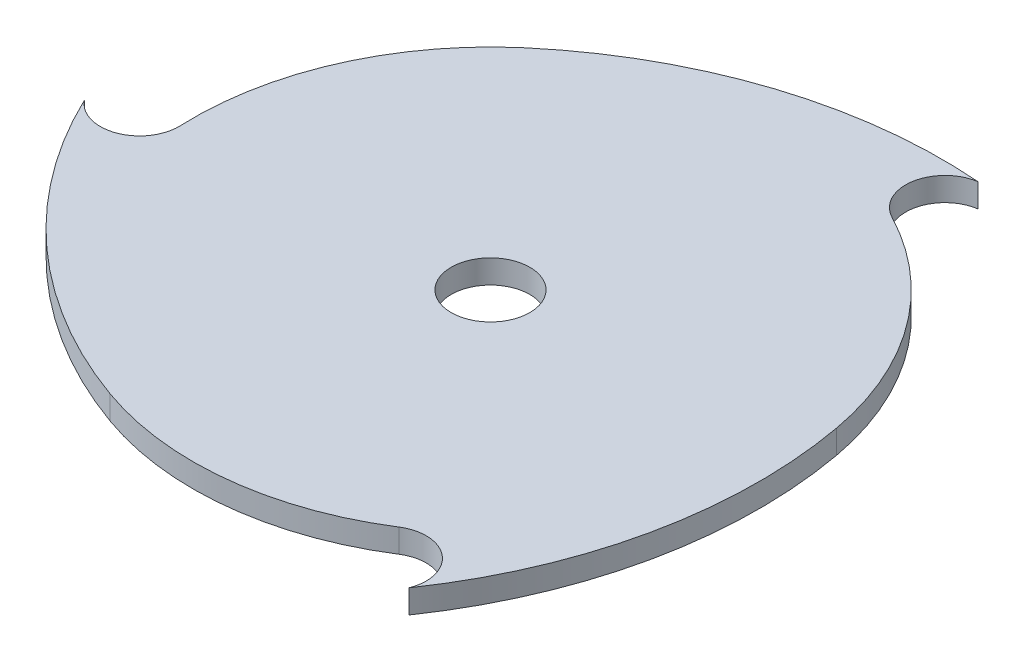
ISO-10303-21;
HEADER;
FILE_DESCRIPTION(('STEP AP214'),'2;1');
FILE_NAME('part.step','',(''),(''),'','','');
FILE_SCHEMA(('AUTOMOTIVE_DESIGN { 1 0 10303 214 1 1 1 1 }'));
ENDSEC;
DATA;
#1=APPLICATION_CONTEXT('core data for automotive mechanical design processes');
#2=APPLICATION_PROTOCOL_DEFINITION('international standard','automotive_design',2000,#1);
#3=PRODUCT_CONTEXT('',#1,'mechanical');
#4=PRODUCT('Part','Part','',(#3));
#5=PRODUCT_RELATED_PRODUCT_CATEGORY('part','',(#4));
#6=PRODUCT_DEFINITION_FORMATION('','',#4);
#7=PRODUCT_DEFINITION_CONTEXT('part definition',#1,'design');
#8=PRODUCT_DEFINITION('design','',#6,#7);
#9=PRODUCT_DEFINITION_SHAPE('','',#8);
#10=(LENGTH_UNIT() NAMED_UNIT(*) SI_UNIT(.MILLI.,.METRE.));
#11=(NAMED_UNIT(*) PLANE_ANGLE_UNIT() SI_UNIT($,.RADIAN.));
#12=(NAMED_UNIT(*) SI_UNIT($,.STERADIAN.) SOLID_ANGLE_UNIT());
#13=UNCERTAINTY_MEASURE_WITH_UNIT(LENGTH_MEASURE(1.E-05),#10,'distance_accuracy_value','');
#14=(GEOMETRIC_REPRESENTATION_CONTEXT(3) GLOBAL_UNCERTAINTY_ASSIGNED_CONTEXT((#13)) GLOBAL_UNIT_ASSIGNED_CONTEXT((#10,
#11,#12)) REPRESENTATION_CONTEXT('',''));
#15=CARTESIAN_POINT('',(0.,0.,0.));
#16=DIRECTION('',(0.,0.,1.));
#17=DIRECTION('',(1.,0.,0.));
#18=AXIS2_PLACEMENT_3D('',#15,#16,#17);
#19=CARTESIAN_POINT('',(14.342518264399,3.,16.8876916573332));
#20=DIRECTION('',(0.,-1.,0.));
#21=DIRECTION('',(0.,0.,-1.));
#22=AXIS2_PLACEMENT_3D('',#19,#20,#21);
#23=CYLINDRICAL_SURFACE('',#22,60.);
#24=CARTESIAN_POINT('',(14.342518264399,0.,16.8876916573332));
#25=DIRECTION('',(0.,1.,0.));
#26=DIRECTION('',(0.,0.,1.));
#27=AXIS2_PLACEMENT_3D('',#24,#25,#26);
#28=CIRCLE('',#27,60.);
#29=CARTESIAN_POINT('',(-24.4974869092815,0.,-28.8447257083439));
#30=VERTEX_POINT('',#29);
#31=CARTESIAN_POINT('',(19.0815873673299,0.,-42.924859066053));
#32=VERTEX_POINT('',#31);
#33=EDGE_CURVE('E138',#30,#32,#28,.F.);
#34=ORIENTED_EDGE('',*,*,#33,.F.);
#35=DIRECTION('',(0.,-1.,0.));
#36=VECTOR('',#35,1.);
#37=CARTESIAN_POINT('',(-24.4974869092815,3.,-28.8447257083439));
#38=LINE('',#37,#36);
#39=CARTESIAN_POINT('',(-24.4974869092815,3.,-28.8447257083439));
#40=VERTEX_POINT('',#39);
#41=EDGE_CURVE('E11',#40,#30,#38,.T.);
#42=ORIENTED_EDGE('',*,*,#41,.F.);
#43=CARTESIAN_POINT('',(14.342518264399,3.,16.8876916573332));
#44=DIRECTION('',(0.,1.,0.));
#45=DIRECTION('',(0.,0.,1.));
#46=AXIS2_PLACEMENT_3D('',#43,#44,#45);
#47=CIRCLE('',#46,60.);
#48=CARTESIAN_POINT('',(19.0815873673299,3.,-42.924859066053));
#49=VERTEX_POINT('',#48);
#50=EDGE_CURVE('E194',#40,#49,#47,.F.);
#51=ORIENTED_EDGE('',*,*,#50,.T.);
#52=DIRECTION('',(0.,-1.,0.));
#53=VECTOR('',#52,1.);
#54=CARTESIAN_POINT('',(19.0815873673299,3.,-42.924859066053));
#55=LINE('',#54,#53);
#56=EDGE_CURVE('E52',#49,#32,#55,.T.);
#57=ORIENTED_EDGE('',*,*,#56,.T.);
#58=EDGE_LOOP('',(#34,#42,#51,#57));
#59=FACE_BOUND('',#58,.T.);
#60=ADVANCED_FACE('F35',(#59),#23,.T.);
#61=CARTESIAN_POINT('',(0.,3.,0.));
#62=DIRECTION('',(0.,-1.,0.));
#63=DIRECTION('',(0.,0.,-1.));
#64=AXIS2_PLACEMENT_3D('',#61,#62,#63);
#65=CYLINDRICAL_SURFACE('',#64,37.8436925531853);
#66=CARTESIAN_POINT('',(0.,0.,0.));
#67=DIRECTION('',(0.,1.,0.));
#68=DIRECTION('',(0.,0.,1.));
#69=AXIS2_PLACEMENT_3D('',#66,#67,#68);
#70=CIRCLE('',#69,37.8436925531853);
#71=CARTESIAN_POINT('',(-37.80950634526,0.,1.6081965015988));
#72=VERTEX_POINT('',#71);
#73=EDGE_CURVE('E140',#30,#72,#70,.T.);
#74=ORIENTED_EDGE('',*,*,#73,.T.);
#75=DIRECTION('',(0.,-1.,0.));
#76=VECTOR('',#75,1.);
#77=CARTESIAN_POINT('',(-37.80950634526,3.,1.6081965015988));
#78=LINE('',#77,#76);
#79=CARTESIAN_POINT('',(-37.80950634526,3.,1.6081965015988));
#80=VERTEX_POINT('',#79);
#81=EDGE_CURVE('E44',#80,#72,#78,.T.);
#82=ORIENTED_EDGE('',*,*,#81,.F.);
#83=CARTESIAN_POINT('',(0.,3.,0.));
#84=DIRECTION('',(0.,1.,0.));
#85=DIRECTION('',(0.,0.,1.));
#86=AXIS2_PLACEMENT_3D('',#83,#84,#85);
#87=CIRCLE('',#86,37.8436925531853);
#88=EDGE_CURVE('E190',#40,#80,#87,.T.);
#89=ORIENTED_EDGE('',*,*,#88,.F.);
#90=ORIENTED_EDGE('',*,*,#41,.T.);
#91=EDGE_LOOP('',(#74,#82,#89,#90));
#92=FACE_BOUND('',#91,.T.);
#93=ADVANCED_FACE('F179',(#92),#65,.T.);
#94=CARTESIAN_POINT('',(-42.8049895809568,3.,1.82067530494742));
#95=DIRECTION('',(0.,-1.,0.));
#96=DIRECTION('',(0.,0.,-1.));
#97=AXIS2_PLACEMENT_3D('',#94,#95,#96);
#98=CYLINDRICAL_SURFACE('',#97,5.);
#99=CARTESIAN_POINT('',(-42.8049895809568,0.,1.82067530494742));
#100=DIRECTION('',(0.,1.,0.));
#101=DIRECTION('',(0.,0.,1.));
#102=AXIS2_PLACEMENT_3D('',#99,#100,#101);
#103=CIRCLE('',#102,5.);
#104=CARTESIAN_POINT('',(-46.7148120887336,0.,4.93729012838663));
#105=VERTEX_POINT('',#104);
#106=EDGE_CURVE('E143',#105,#72,#103,.T.);
#107=ORIENTED_EDGE('',*,*,#106,.F.);
#108=DIRECTION('',(0.,-1.,0.));
#109=VECTOR('',#108,1.);
#110=CARTESIAN_POINT('',(-46.7148120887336,3.,4.93729012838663));
#111=LINE('',#110,#109);
#112=CARTESIAN_POINT('',(-46.7148120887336,3.,4.93729012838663));
#113=VERTEX_POINT('',#112);
#114=EDGE_CURVE('E169',#113,#105,#111,.T.);
#115=ORIENTED_EDGE('',*,*,#114,.F.);
#116=CARTESIAN_POINT('',(-42.8049895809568,3.,1.82067530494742));
#117=DIRECTION('',(0.,1.,0.));
#118=DIRECTION('',(0.,0.,1.));
#119=AXIS2_PLACEMENT_3D('',#116,#117,#118);
#120=CIRCLE('',#119,5.);
#121=EDGE_CURVE('E176',#113,#80,#120,.T.);
#122=ORIENTED_EDGE('',*,*,#121,.T.);
#123=ORIENTED_EDGE('',*,*,#81,.T.);
#124=EDGE_LOOP('',(#107,#115,#122,#123));
#125=FACE_BOUND('',#124,.T.);
#126=ADVANCED_FACE('F174',(#125),#98,.F.);
#127=CARTESIAN_POINT('',(7.45391085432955,3.,-20.8648309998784));
#128=DIRECTION('',(0.,-1.,0.));
#129=DIRECTION('',(0.,0.,-1.));
#130=AXIS2_PLACEMENT_3D('',#127,#128,#129);
#131=CYLINDRICAL_SURFACE('',#130,60.);
#132=CARTESIAN_POINT('',(7.45391085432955,0.,-20.8648309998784));
#133=DIRECTION('',(0.,1.,0.));
#134=DIRECTION('',(0.,0.,1.));
#135=AXIS2_PLACEMENT_3D('',#132,#133,#134);
#136=CIRCLE('',#135,60.);
#137=CARTESIAN_POINT('',(-12.7315217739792,0.,35.6378088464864));
#138=VERTEX_POINT('',#137);
#139=EDGE_CURVE('E146',#138,#105,#136,.F.);
#140=ORIENTED_EDGE('',*,*,#139,.F.);
#141=DIRECTION('',(0.,-1.,0.));
#142=VECTOR('',#141,1.);
#143=CARTESIAN_POINT('',(-12.7315217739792,3.,35.6378088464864));
#144=LINE('',#143,#142);
#145=CARTESIAN_POINT('',(-12.7315217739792,3.,35.6378088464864));
#146=VERTEX_POINT('',#145);
#147=EDGE_CURVE('E167',#146,#138,#144,.T.);
#148=ORIENTED_EDGE('',*,*,#147,.F.);
#149=CARTESIAN_POINT('',(7.45391085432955,3.,-20.8648309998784));
#150=DIRECTION('',(0.,1.,0.));
#151=DIRECTION('',(0.,0.,1.));
#152=AXIS2_PLACEMENT_3D('',#149,#150,#151);
#153=CIRCLE('',#152,60.);
#154=EDGE_CURVE('E189',#146,#113,#153,.F.);
#155=ORIENTED_EDGE('',*,*,#154,.T.);
#156=ORIENTED_EDGE('',*,*,#114,.T.);
#157=EDGE_LOOP('',(#140,#148,#155,#156));
#158=FACE_BOUND('',#157,.T.);
#159=ADVANCED_FACE('F185',(#158),#131,.T.);
#160=CARTESIAN_POINT('',(0.,3.,0.));
#161=DIRECTION('',(0.,-1.,0.));
#162=DIRECTION('',(0.,0.,-1.));
#163=AXIS2_PLACEMENT_3D('',#160,#161,#162);
#164=CYLINDRICAL_SURFACE('',#163,37.8436925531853);
#165=CARTESIAN_POINT('',(0.,0.,0.));
#166=DIRECTION('',(0.,1.,0.));
#167=DIRECTION('',(0.,0.,1.));
#168=AXIS2_PLACEMENT_3D('',#165,#166,#167);
#169=CIRCLE('',#168,37.8436925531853);
#170=CARTESIAN_POINT('',(20.2974921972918,0.,31.9398947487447));
#171=VERTEX_POINT('',#170);
#172=EDGE_CURVE('E149',#138,#171,#169,.T.);
#173=ORIENTED_EDGE('',*,*,#172,.T.);
#174=DIRECTION('',(0.,-1.,0.));
#175=VECTOR('',#174,1.);
#176=CARTESIAN_POINT('',(20.2974921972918,3.,31.9398947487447));
#177=LINE('',#176,#175);
#178=CARTESIAN_POINT('',(20.2974921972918,3.,31.9398947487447));
#179=VERTEX_POINT('',#178);
#180=EDGE_CURVE('E165',#179,#171,#177,.T.);
#181=ORIENTED_EDGE('',*,*,#180,.F.);
#182=CARTESIAN_POINT('',(0.,3.,0.));
#183=DIRECTION('',(0.,1.,0.));
#184=DIRECTION('',(0.,0.,1.));
#185=AXIS2_PLACEMENT_3D('',#182,#183,#184);
#186=CIRCLE('',#185,37.8436925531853);
#187=EDGE_CURVE('E192',#146,#179,#186,.T.);
#188=ORIENTED_EDGE('',*,*,#187,.F.);
#189=ORIENTED_EDGE('',*,*,#147,.T.);
#190=EDGE_LOOP('',(#173,#181,#188,#189));
#191=FACE_BOUND('',#190,.T.);
#192=ADVANCED_FACE('F224',(#191),#164,.T.);
#193=CARTESIAN_POINT('',(22.9792458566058,3.,36.1598707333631));
#194=DIRECTION('',(0.,-1.,0.));
#195=DIRECTION('',(0.,0.,-1.));
#196=AXIS2_PLACEMENT_3D('',#193,#194,#195);
#197=CYLINDRICAL_SURFACE('',#196,5.);
#198=CARTESIAN_POINT('',(22.9792458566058,0.,36.1598707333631));
#199=DIRECTION('',(0.,1.,0.));
#200=DIRECTION('',(0.,0.,1.));
#201=AXIS2_PLACEMENT_3D('',#198,#199,#200);
#202=CIRCLE('',#201,5.);
#203=CARTESIAN_POINT('',(27.6332247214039,0.,37.9875689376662));
#204=VERTEX_POINT('',#203);
#205=EDGE_CURVE('E152',#204,#171,#202,.T.);
#206=ORIENTED_EDGE('',*,*,#205,.F.);
#207=DIRECTION('',(0.,-1.,0.));
#208=VECTOR('',#207,1.);
#209=CARTESIAN_POINT('',(27.6332247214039,3.,37.9875689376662));
#210=LINE('',#209,#208);
#211=CARTESIAN_POINT('',(27.6332247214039,3.,37.9875689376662));
#212=VERTEX_POINT('',#211);
#213=EDGE_CURVE('E117',#212,#204,#210,.T.);
#214=ORIENTED_EDGE('',*,*,#213,.F.);
#215=CARTESIAN_POINT('',(22.9792458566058,3.,36.1598707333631));
#216=DIRECTION('',(0.,1.,0.));
#217=DIRECTION('',(0.,0.,1.));
#218=AXIS2_PLACEMENT_3D('',#215,#216,#217);
#219=CIRCLE('',#218,5.);
#220=EDGE_CURVE('E127',#212,#179,#219,.T.);
#221=ORIENTED_EDGE('',*,*,#220,.T.);
#222=ORIENTED_EDGE('',*,*,#180,.T.);
#223=EDGE_LOOP('',(#206,#214,#221,#222));
#224=FACE_BOUND('',#223,.T.);
#225=ADVANCED_FACE('F200',(#224),#197,.F.);
#226=CARTESIAN_POINT('',(-21.7964291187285,3.,3.97713934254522));
#227=DIRECTION('',(0.,-1.,0.));
#228=DIRECTION('',(0.,0.,-1.));
#229=AXIS2_PLACEMENT_3D('',#226,#227,#228);
#230=CYLINDRICAL_SURFACE('',#229,60.);
#231=CARTESIAN_POINT('',(-21.7964291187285,0.,3.97713934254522));
#232=DIRECTION('',(0.,1.,0.));
#233=DIRECTION('',(0.,0.,1.));
#234=AXIS2_PLACEMENT_3D('',#231,#232,#233);
#235=CIRCLE('',#234,60.);
#236=CARTESIAN_POINT('',(37.2290086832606,0.,-6.79308313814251));
#237=VERTEX_POINT('',#236);
#238=EDGE_CURVE('E113',#237,#204,#235,.F.);
#239=ORIENTED_EDGE('',*,*,#238,.F.);
#240=DIRECTION('',(0.,-1.,0.));
#241=VECTOR('',#240,1.);
#242=CARTESIAN_POINT('',(37.2290086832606,3.,-6.79308313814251));
#243=LINE('',#242,#241);
#244=CARTESIAN_POINT('',(37.2290086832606,3.,-6.79308313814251));
#245=VERTEX_POINT('',#244);
#246=EDGE_CURVE('E108',#245,#237,#243,.T.);
#247=ORIENTED_EDGE('',*,*,#246,.F.);
#248=CARTESIAN_POINT('',(-21.7964291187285,3.,3.97713934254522));
#249=DIRECTION('',(0.,1.,0.));
#250=DIRECTION('',(0.,0.,1.));
#251=AXIS2_PLACEMENT_3D('',#248,#249,#250);
#252=CIRCLE('',#251,60.);
#253=EDGE_CURVE('E111',#245,#212,#252,.F.);
#254=ORIENTED_EDGE('',*,*,#253,.T.);
#255=ORIENTED_EDGE('',*,*,#213,.T.);
#256=EDGE_LOOP('',(#239,#247,#254,#255));
#257=FACE_BOUND('',#256,.T.);
#258=ADVANCED_FACE('F110',(#257),#230,.T.);
#259=CARTESIAN_POINT('',(0.,3.,0.));
#260=DIRECTION('',(0.,-1.,0.));
#261=DIRECTION('',(0.,0.,-1.));
#262=AXIS2_PLACEMENT_3D('',#259,#260,#261);
#263=CYLINDRICAL_SURFACE('',#262,37.8436925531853);
#264=CARTESIAN_POINT('',(0.,0.,0.));
#265=DIRECTION('',(0.,1.,0.));
#266=DIRECTION('',(0.,0.,1.));
#267=AXIS2_PLACEMENT_3D('',#264,#265,#266);
#268=CIRCLE('',#267,37.8436925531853);
#269=CARTESIAN_POINT('',(17.5120141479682,0.,-33.5480912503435));
#270=VERTEX_POINT('',#269);
#271=EDGE_CURVE('E156',#270,#237,#268,.F.);
#272=ORIENTED_EDGE('',*,*,#271,.F.);
#273=DIRECTION('',(0.,-1.,0.));
#274=VECTOR('',#273,1.);
#275=CARTESIAN_POINT('',(17.5120141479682,3.,-33.5480912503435));
#276=LINE('',#275,#274);
#277=CARTESIAN_POINT('',(17.5120141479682,3.,-33.5480912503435));
#278=VERTEX_POINT('',#277);
#279=EDGE_CURVE('E80',#278,#270,#276,.T.);
#280=ORIENTED_EDGE('',*,*,#279,.F.);
#281=CARTESIAN_POINT('',(0.,3.,0.));
#282=DIRECTION('',(0.,1.,0.));
#283=DIRECTION('',(0.,0.,1.));
#284=AXIS2_PLACEMENT_3D('',#281,#282,#283);
#285=CIRCLE('',#284,37.8436925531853);
#286=EDGE_CURVE('E125',#278,#245,#285,.F.);
#287=ORIENTED_EDGE('',*,*,#286,.T.);
#288=ORIENTED_EDGE('',*,*,#246,.T.);
#289=EDGE_LOOP('',(#272,#280,#287,#288));
#290=FACE_BOUND('',#289,.T.);
#291=ADVANCED_FACE('F129',(#290),#263,.T.);
#292=CARTESIAN_POINT('',(0.,3.,0.));
#293=DIRECTION('',(0.,-1.,0.));
#294=DIRECTION('',(0.,0.,-1.));
#295=AXIS2_PLACEMENT_3D('',#292,#293,#294);
#296=CYLINDRICAL_SURFACE('',#295,5.);
#297=CARTESIAN_POINT('',(0.,3.,0.));
#298=DIRECTION('',(0.,1.,0.));
#299=DIRECTION('',(0.,0.,1.));
#300=AXIS2_PLACEMENT_3D('',#297,#298,#299);
#301=CIRCLE('',#300,5.);
#302=CARTESIAN_POINT('',(0.,3.,5.));
#303=VERTEX_POINT('',#302);
#304=EDGE_CURVE('E161',#303,#303,#301,.T.);
#305=ORIENTED_EDGE('',*,*,#304,.T.);
#306=EDGE_LOOP('',(#305));
#307=FACE_BOUND('',#306,.T.);
#308=CARTESIAN_POINT('',(0.,0.,0.));
#309=DIRECTION('',(0.,1.,0.));
#310=DIRECTION('',(0.,0.,1.));
#311=AXIS2_PLACEMENT_3D('',#308,#309,#310);
#312=CIRCLE('',#311,5.);
#313=CARTESIAN_POINT('',(0.,0.,5.));
#314=VERTEX_POINT('',#313);
#315=EDGE_CURVE('E135',#314,#314,#312,.T.);
#316=ORIENTED_EDGE('',*,*,#315,.F.);
#317=EDGE_LOOP('',(#316));
#318=FACE_BOUND('',#317,.T.);
#319=ADVANCED_FACE('F37',(#307,#318),#296,.F.);
#320=CARTESIAN_POINT('',(19.825743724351,3.,-37.9805460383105));
#321=DIRECTION('',(0.,-1.,0.));
#322=DIRECTION('',(0.,0.,-1.));
#323=AXIS2_PLACEMENT_3D('',#320,#321,#322);
#324=CYLINDRICAL_SURFACE('',#323,5.);
#325=CARTESIAN_POINT('',(19.825743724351,0.,-37.9805460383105));
#326=DIRECTION('',(0.,1.,0.));
#327=DIRECTION('',(0.,0.,1.));
#328=AXIS2_PLACEMENT_3D('',#325,#326,#327);
#329=CIRCLE('',#328,5.);
#330=EDGE_CURVE('E158',#32,#270,#329,.T.);
#331=ORIENTED_EDGE('',*,*,#330,.F.);
#332=ORIENTED_EDGE('',*,*,#56,.F.);
#333=CARTESIAN_POINT('',(19.825743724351,3.,-37.9805460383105));
#334=DIRECTION('',(0.,1.,0.));
#335=DIRECTION('',(0.,0.,1.));
#336=AXIS2_PLACEMENT_3D('',#333,#334,#335);
#337=CIRCLE('',#336,5.);
#338=EDGE_CURVE('E130',#49,#278,#337,.T.);
#339=ORIENTED_EDGE('',*,*,#338,.T.);
#340=ORIENTED_EDGE('',*,*,#279,.T.);
#341=EDGE_LOOP('',(#331,#332,#339,#340));
#342=FACE_BOUND('',#341,.T.);
#343=ADVANCED_FACE('F202',(#342),#324,.F.);
#344=CARTESIAN_POINT('',(0.,3.,0.));
#345=DIRECTION('',(0.,1.,0.));
#346=DIRECTION('',(0.,0.,1.));
#347=AXIS2_PLACEMENT_3D('',#344,#345,#346);
#348=PLANE('',#347);
#349=ORIENTED_EDGE('',*,*,#304,.F.);
#350=EDGE_LOOP('',(#349));
#351=FACE_BOUND('',#350,.T.);
#352=ORIENTED_EDGE('',*,*,#50,.F.);
#353=ORIENTED_EDGE('',*,*,#88,.T.);
#354=ORIENTED_EDGE('',*,*,#121,.F.);
#355=ORIENTED_EDGE('',*,*,#154,.F.);
#356=ORIENTED_EDGE('',*,*,#187,.T.);
#357=ORIENTED_EDGE('',*,*,#220,.F.);
#358=ORIENTED_EDGE('',*,*,#253,.F.);
#359=ORIENTED_EDGE('',*,*,#286,.F.);
#360=ORIENTED_EDGE('',*,*,#338,.F.);
#361=EDGE_LOOP('',(#352,#353,#354,#355,#356,#357,#358,#359,#360));
#362=FACE_BOUND('',#361,.T.);
#363=ADVANCED_FACE('F123',(#351,#362),#348,.T.);
#364=CARTESIAN_POINT('',(0.,0.,0.));
#365=DIRECTION('',(0.,1.,0.));
#366=DIRECTION('',(0.,0.,1.));
#367=AXIS2_PLACEMENT_3D('',#364,#365,#366);
#368=PLANE('',#367);
#369=ORIENTED_EDGE('',*,*,#315,.T.);
#370=EDGE_LOOP('',(#369));
#371=FACE_BOUND('',#370,.T.);
#372=ORIENTED_EDGE('',*,*,#33,.T.);
#373=ORIENTED_EDGE('',*,*,#330,.T.);
#374=ORIENTED_EDGE('',*,*,#271,.T.);
#375=ORIENTED_EDGE('',*,*,#238,.T.);
#376=ORIENTED_EDGE('',*,*,#205,.T.);
#377=ORIENTED_EDGE('',*,*,#172,.F.);
#378=ORIENTED_EDGE('',*,*,#139,.T.);
#379=ORIENTED_EDGE('',*,*,#106,.T.);
#380=ORIENTED_EDGE('',*,*,#73,.F.);
#381=EDGE_LOOP('',(#372,#373,#374,#375,#376,#377,#378,#379,#380));
#382=FACE_BOUND('',#381,.T.);
#383=ADVANCED_FACE('F181',(#371,#382),#368,.F.);
#384=CLOSED_SHELL('',(#60,#93,#126,#159,#192,#225,#258,#291,#319,#343,#363,#383));
#385=MANIFOLD_SOLID_BREP('B2',#384);
#386=ADVANCED_BREP_SHAPE_REPRESENTATION('',(#18,#385),#14);
#387=SHAPE_DEFINITION_REPRESENTATION(#9,#386);
ENDSEC;
END-ISO-10303-21;
